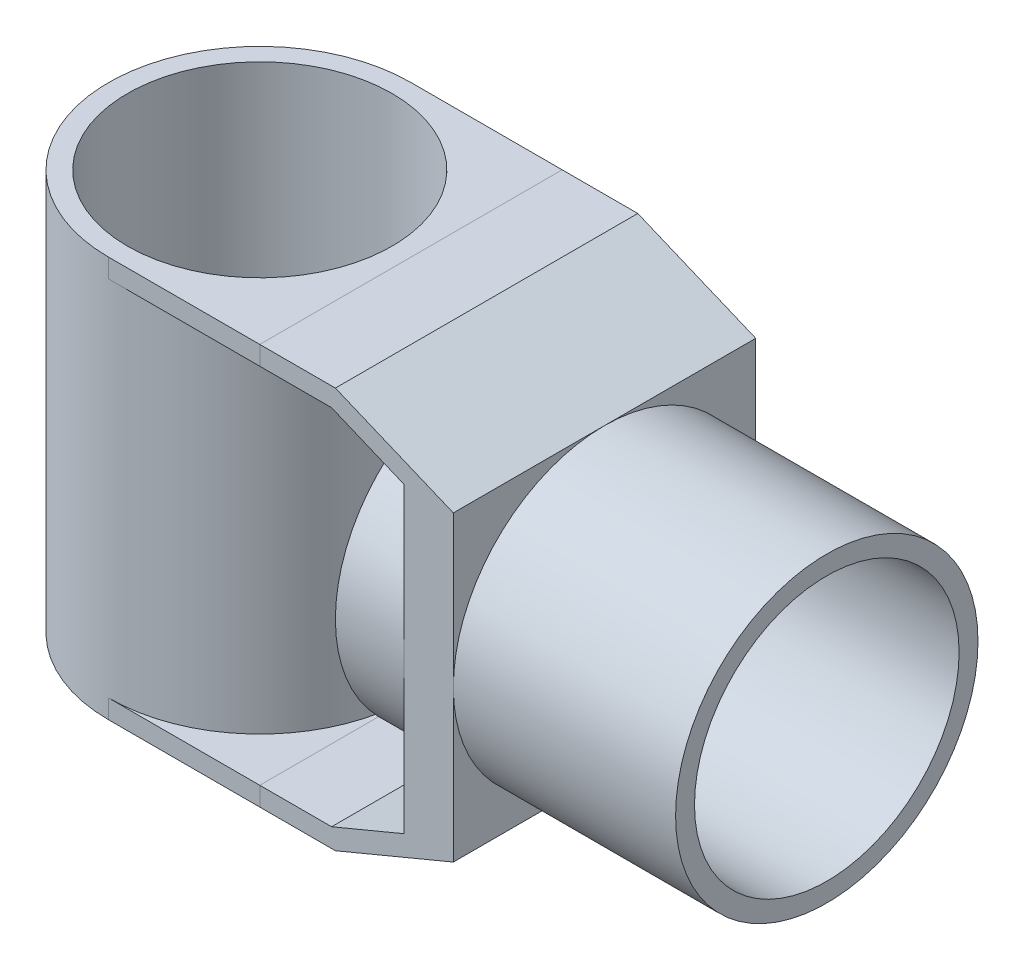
ISO-10303-21;
HEADER;
FILE_DESCRIPTION(('STEP AP214'),'2;1');
FILE_NAME('part.step','',(''),(''),'','','');
FILE_SCHEMA(('AUTOMOTIVE_DESIGN { 1 0 10303 214 1 1 1 1 }'));
ENDSEC;
DATA;
#1=APPLICATION_CONTEXT('core data for automotive mechanical design processes');
#2=APPLICATION_PROTOCOL_DEFINITION('international standard','automotive_design',2000,#1);
#3=PRODUCT_CONTEXT('',#1,'mechanical');
#4=PRODUCT('Part','Part','',(#3));
#5=PRODUCT_RELATED_PRODUCT_CATEGORY('part','',(#4));
#6=PRODUCT_DEFINITION_FORMATION('','',#4);
#7=PRODUCT_DEFINITION_CONTEXT('part definition',#1,'design');
#8=PRODUCT_DEFINITION('design','',#6,#7);
#9=PRODUCT_DEFINITION_SHAPE('','',#8);
#10=(LENGTH_UNIT() NAMED_UNIT(*) SI_UNIT(.MILLI.,.METRE.));
#11=(NAMED_UNIT(*) PLANE_ANGLE_UNIT() SI_UNIT($,.RADIAN.));
#12=(NAMED_UNIT(*) SI_UNIT($,.STERADIAN.) SOLID_ANGLE_UNIT());
#13=UNCERTAINTY_MEASURE_WITH_UNIT(LENGTH_MEASURE(1.E-05),#10,'distance_accuracy_value','');
#14=(GEOMETRIC_REPRESENTATION_CONTEXT(3) GLOBAL_UNCERTAINTY_ASSIGNED_CONTEXT((#13)) GLOBAL_UNIT_ASSIGNED_CONTEXT((#10,
#11,#12)) REPRESENTATION_CONTEXT('',''));
#15=CARTESIAN_POINT('',(0.,0.,0.));
#16=DIRECTION('',(0.,0.,1.));
#17=DIRECTION('',(1.,0.,0.));
#18=AXIS2_PLACEMENT_3D('',#15,#16,#17);
#19=CARTESIAN_POINT('',(180.,0.,0.));
#20=DIRECTION('',(-1.,0.,0.));
#21=DIRECTION('',(0.,0.,1.));
#22=AXIS2_PLACEMENT_3D('',#19,#20,#21);
#23=CYLINDRICAL_SURFACE('',#22,80.);
#24=CARTESIAN_POINT('',(0.,0.,0.));
#25=DIRECTION('',(-1.,0.,0.));
#26=DIRECTION('',(0.,0.,1.));
#27=AXIS2_PLACEMENT_3D('',#24,#25,#26);
#28=CIRCLE('',#27,80.);
#29=CARTESIAN_POINT('',(0.,0.,80.));
#30=VERTEX_POINT('',#29);
#31=EDGE_CURVE('E319',#30,#30,#28,.T.);
#32=ORIENTED_EDGE('',*,*,#31,.F.);
#33=EDGE_LOOP('',(#32));
#34=FACE_BOUND('',#33,.T.);
#35=CARTESIAN_POINT('',(36.4000000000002,0.,0.));
#36=DIRECTION('',(1.,0.,0.));
#37=DIRECTION('',(0.,1.,0.));
#38=AXIS2_PLACEMENT_3D('',#35,#36,#37);
#39=CIRCLE('',#38,80.);
#40=CARTESIAN_POINT('',(36.4000000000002,80.,0.));
#41=VERTEX_POINT('',#40);
#42=CARTESIAN_POINT('',(36.4000000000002,0.,80.));
#43=VERTEX_POINT('',#42);
#44=EDGE_CURVE('E327',#41,#43,#39,.T.);
#45=ORIENTED_EDGE('',*,*,#44,.F.);
#46=CARTESIAN_POINT('',(36.4000000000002,0.,0.));
#47=DIRECTION('',(1.,0.,0.));
#48=DIRECTION('',(0.,1.,0.));
#49=AXIS2_PLACEMENT_3D('',#46,#47,#48);
#50=CIRCLE('',#49,80.);
#51=CARTESIAN_POINT('',(36.4000000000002,0.,-80.));
#52=VERTEX_POINT('',#51);
#53=EDGE_CURVE('E201',#52,#41,#50,.T.);
#54=ORIENTED_EDGE('',*,*,#53,.F.);
#55=CARTESIAN_POINT('',(36.4000000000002,0.,0.));
#56=DIRECTION('',(1.,0.,0.));
#57=DIRECTION('',(0.,0.,-1.));
#58=AXIS2_PLACEMENT_3D('',#55,#56,#57);
#59=CIRCLE('',#58,80.);
#60=CARTESIAN_POINT('',(36.4000000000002,-80.,0.));
#61=VERTEX_POINT('',#60);
#62=EDGE_CURVE('E303',#61,#52,#59,.T.);
#63=ORIENTED_EDGE('',*,*,#62,.F.);
#64=CARTESIAN_POINT('',(36.4000000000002,0.,0.));
#65=DIRECTION('',(1.,0.,0.));
#66=DIRECTION('',(0.,0.,-1.));
#67=AXIS2_PLACEMENT_3D('',#64,#65,#66);
#68=CIRCLE('',#67,80.);
#69=EDGE_CURVE('E222',#43,#61,#68,.T.);
#70=ORIENTED_EDGE('',*,*,#69,.F.);
#71=EDGE_LOOP('',(#45,#54,#63,#70));
#72=FACE_BOUND('',#71,.T.);
#73=ADVANCED_FACE('F49',(#34,#72),#23,.T.);
#74=CARTESIAN_POINT('',(180.,0.,0.));
#75=DIRECTION('',(-1.,0.,0.));
#76=DIRECTION('',(0.,0.,1.));
#77=AXIS2_PLACEMENT_3D('',#74,#75,#76);
#78=CIRCLE('',#77,80.);
#79=CARTESIAN_POINT('',(180.,0.,80.));
#80=VERTEX_POINT('',#79);
#81=EDGE_CURVE('E323',#80,#80,#78,.T.);
#82=ORIENTED_EDGE('',*,*,#81,.T.);
#83=EDGE_LOOP('',(#82));
#84=FACE_BOUND('',#83,.T.);
#85=CARTESIAN_POINT('',(62.4000000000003,0.,0.));
#86=DIRECTION('',(-1.,0.,0.));
#87=DIRECTION('',(0.,0.,1.));
#88=AXIS2_PLACEMENT_3D('',#85,#86,#87);
#89=CIRCLE('',#88,80.);
#90=CARTESIAN_POINT('',(62.4000000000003,0.,-80.));
#91=VERTEX_POINT('',#90);
#92=CARTESIAN_POINT('',(62.4000000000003,-80.,0.));
#93=VERTEX_POINT('',#92);
#94=EDGE_CURVE('E294',#91,#93,#89,.T.);
#95=ORIENTED_EDGE('',*,*,#94,.F.);
#96=CARTESIAN_POINT('',(62.4000000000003,0.,0.));
#97=DIRECTION('',(-1.,0.,0.));
#98=DIRECTION('',(0.,-1.,0.));
#99=AXIS2_PLACEMENT_3D('',#96,#97,#98);
#100=CIRCLE('',#99,80.);
#101=CARTESIAN_POINT('',(62.4000000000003,80.,0.));
#102=VERTEX_POINT('',#101);
#103=EDGE_CURVE('E195',#102,#91,#100,.T.);
#104=ORIENTED_EDGE('',*,*,#103,.F.);
#105=CARTESIAN_POINT('',(62.4000000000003,0.,0.));
#106=DIRECTION('',(-1.,0.,0.));
#107=DIRECTION('',(0.,-1.,0.));
#108=AXIS2_PLACEMENT_3D('',#105,#106,#107);
#109=CIRCLE('',#108,80.);
#110=CARTESIAN_POINT('',(62.4000000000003,0.,80.));
#111=VERTEX_POINT('',#110);
#112=EDGE_CURVE('E120',#111,#102,#109,.T.);
#113=ORIENTED_EDGE('',*,*,#112,.F.);
#114=CARTESIAN_POINT('',(62.4000000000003,0.,0.));
#115=DIRECTION('',(-1.,0.,0.));
#116=DIRECTION('',(0.,0.,1.));
#117=AXIS2_PLACEMENT_3D('',#114,#115,#116);
#118=CIRCLE('',#117,80.);
#119=EDGE_CURVE('E217',#93,#111,#118,.T.);
#120=ORIENTED_EDGE('',*,*,#119,.F.);
#121=EDGE_LOOP('',(#95,#104,#113,#120));
#122=FACE_BOUND('',#121,.T.);
#123=ADVANCED_FACE('F352',(#84,#122),#23,.T.);
#124=CARTESIAN_POINT('',(-40.,106.,80.));
#125=DIRECTION('',(1.,0.,0.));
#126=DIRECTION('',(0.,0.,-1.));
#127=AXIS2_PLACEMENT_3D('',#124,#125,#126);
#128=PLANE('',#127);
#129=DIRECTION('',(0.,-1.,0.));
#130=VECTOR('',#129,1.);
#131=CARTESIAN_POINT('',(-40.,106.,-80.));
#132=LINE('',#131,#130);
#133=CARTESIAN_POINT('',(-40.,106.,-80.));
#134=VERTEX_POINT('',#133);
#135=CARTESIAN_POINT('',(-40.,96.,-80.));
#136=VERTEX_POINT('',#135);
#137=EDGE_CURVE('E149',#134,#136,#132,.T.);
#138=ORIENTED_EDGE('',*,*,#137,.T.);
#139=DIRECTION('',(0.,0.,-1.));
#140=VECTOR('',#139,1.);
#141=CARTESIAN_POINT('',(-40.,96.,80.));
#142=LINE('',#141,#140);
#143=CARTESIAN_POINT('',(-40.,96.,80.));
#144=VERTEX_POINT('',#143);
#145=EDGE_CURVE('E12',#144,#136,#142,.T.);
#146=ORIENTED_EDGE('',*,*,#145,.F.);
#147=DIRECTION('',(0.,-1.,0.));
#148=VECTOR('',#147,1.);
#149=CARTESIAN_POINT('',(-40.,106.,80.));
#150=LINE('',#149,#148);
#151=CARTESIAN_POINT('',(-40.,106.,80.));
#152=VERTEX_POINT('',#151);
#153=EDGE_CURVE('E163',#152,#144,#150,.T.);
#154=ORIENTED_EDGE('',*,*,#153,.F.);
#155=DIRECTION('',(0.,0.,-1.));
#156=VECTOR('',#155,1.);
#157=CARTESIAN_POINT('',(-40.,106.,80.));
#158=LINE('',#157,#156);
#159=EDGE_CURVE('E143',#152,#134,#158,.T.);
#160=ORIENTED_EDGE('',*,*,#159,.T.);
#161=EDGE_LOOP('',(#138,#146,#154,#160));
#162=FACE_BOUND('',#161,.T.);
#163=ADVANCED_FACE('F51',(#162),#128,.F.);
#164=CARTESIAN_POINT('',(-40.,96.,80.));
#165=DIRECTION('',(0.,1.,0.));
#166=DIRECTION('',(0.,0.,1.));
#167=AXIS2_PLACEMENT_3D('',#164,#165,#166);
#168=PLANE('',#167);
#169=DIRECTION('',(1.,0.,0.));
#170=VECTOR('',#169,1.);
#171=CARTESIAN_POINT('',(-40.,96.,-80.));
#172=LINE('',#171,#170);
#173=CARTESIAN_POINT('',(-1.99999999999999,96.,-80.));
#174=VERTEX_POINT('',#173);
#175=EDGE_CURVE('E153',#136,#174,#172,.T.);
#176=ORIENTED_EDGE('',*,*,#175,.T.);
#177=DIRECTION('',(0.,0.,-1.));
#178=VECTOR('',#177,1.);
#179=CARTESIAN_POINT('',(-1.99999999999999,96.,80.));
#180=LINE('',#179,#178);
#181=CARTESIAN_POINT('',(-1.99999999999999,96.,80.));
#182=VERTEX_POINT('',#181);
#183=EDGE_CURVE('E59',#182,#174,#180,.T.);
#184=ORIENTED_EDGE('',*,*,#183,.F.);
#185=DIRECTION('',(1.,0.,0.));
#186=VECTOR('',#185,1.);
#187=CARTESIAN_POINT('',(-40.,96.,80.));
#188=LINE('',#187,#186);
#189=EDGE_CURVE('E104',#144,#182,#188,.T.);
#190=ORIENTED_EDGE('',*,*,#189,.F.);
#191=ORIENTED_EDGE('',*,*,#145,.T.);
#192=EDGE_LOOP('',(#176,#184,#190,#191));
#193=FACE_BOUND('',#192,.T.);
#194=ADVANCED_FACE('F345',(#193),#168,.F.);
#195=CARTESIAN_POINT('',(-1.99999999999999,96.,80.));
#196=DIRECTION('',(0.384615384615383,0.923076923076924,0.));
#197=DIRECTION('',(-0.923076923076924,0.384615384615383,0.));
#198=AXIS2_PLACEMENT_3D('',#195,#196,#197);
#199=PLANE('',#198);
#200=DIRECTION('',(0.923076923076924,-0.384615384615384,0.));
#201=VECTOR('',#200,1.);
#202=CARTESIAN_POINT('',(-1.99999999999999,96.,-80.));
#203=LINE('',#202,#201);
#204=CARTESIAN_POINT('',(36.4000000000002,80.,-80.));
#205=VERTEX_POINT('',#204);
#206=EDGE_CURVE('E156',#174,#205,#203,.T.);
#207=ORIENTED_EDGE('',*,*,#206,.T.);
#208=DIRECTION('',(0.,0.,-1.));
#209=VECTOR('',#208,1.);
#210=CARTESIAN_POINT('',(36.4000000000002,80.,80.));
#211=LINE('',#210,#209);
#212=EDGE_CURVE('E124',#41,#205,#211,.T.);
#213=ORIENTED_EDGE('',*,*,#212,.F.);
#214=CARTESIAN_POINT('',(36.4000000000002,80.,80.));
#215=VERTEX_POINT('',#214);
#216=EDGE_CURVE('E168',#215,#41,#211,.T.);
#217=ORIENTED_EDGE('',*,*,#216,.F.);
#218=DIRECTION('',(0.923076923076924,-0.384615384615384,0.));
#219=VECTOR('',#218,1.);
#220=CARTESIAN_POINT('',(-1.99999999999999,96.,80.));
#221=LINE('',#220,#219);
#222=EDGE_CURVE('E139',#182,#215,#221,.T.);
#223=ORIENTED_EDGE('',*,*,#222,.F.);
#224=ORIENTED_EDGE('',*,*,#183,.T.);
#225=EDGE_LOOP('',(#207,#213,#217,#223,#224));
#226=FACE_BOUND('',#225,.T.);
#227=ADVANCED_FACE('F176',(#226),#199,.F.);
#228=CARTESIAN_POINT('',(0.,106.,80.));
#229=DIRECTION('',(-0.384615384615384,-0.923076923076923,0.));
#230=DIRECTION('',(0.923076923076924,-0.384615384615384,0.));
#231=AXIS2_PLACEMENT_3D('',#228,#229,#230);
#232=PLANE('',#231);
#233=DIRECTION('',(-0.923076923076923,0.384615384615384,0.));
#234=VECTOR('',#233,1.);
#235=CARTESIAN_POINT('',(0.,106.,-80.));
#236=LINE('',#235,#234);
#237=CARTESIAN_POINT('',(62.4000000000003,80.,-80.));
#238=VERTEX_POINT('',#237);
#239=CARTESIAN_POINT('',(0.,106.,-80.));
#240=VERTEX_POINT('',#239);
#241=EDGE_CURVE('E90',#238,#240,#236,.T.);
#242=ORIENTED_EDGE('',*,*,#241,.T.);
#243=DIRECTION('',(0.,0.,-1.));
#244=VECTOR('',#243,1.);
#245=CARTESIAN_POINT('',(0.,106.,80.));
#246=LINE('',#245,#244);
#247=CARTESIAN_POINT('',(0.,106.,80.));
#248=VERTEX_POINT('',#247);
#249=EDGE_CURVE('E137',#248,#240,#246,.T.);
#250=ORIENTED_EDGE('',*,*,#249,.F.);
#251=DIRECTION('',(-0.923076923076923,0.384615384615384,0.));
#252=VECTOR('',#251,1.);
#253=CARTESIAN_POINT('',(0.,106.,80.));
#254=LINE('',#253,#252);
#255=CARTESIAN_POINT('',(62.4000000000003,80.,80.));
#256=VERTEX_POINT('',#255);
#257=EDGE_CURVE('E129',#256,#248,#254,.T.);
#258=ORIENTED_EDGE('',*,*,#257,.F.);
#259=DIRECTION('',(0.,0.,-1.));
#260=VECTOR('',#259,1.);
#261=CARTESIAN_POINT('',(62.4000000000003,80.,80.));
#262=LINE('',#261,#260);
#263=EDGE_CURVE('E113',#256,#102,#262,.T.);
#264=ORIENTED_EDGE('',*,*,#263,.T.);
#265=EDGE_CURVE('E125',#102,#238,#262,.T.);
#266=ORIENTED_EDGE('',*,*,#265,.T.);
#267=EDGE_LOOP('',(#242,#250,#258,#264,#266));
#268=FACE_BOUND('',#267,.T.);
#269=ADVANCED_FACE('F136',(#268),#232,.F.);
#270=CARTESIAN_POINT('',(-40.,106.,80.));
#271=DIRECTION('',(0.,-1.,0.));
#272=DIRECTION('',(0.,0.,-1.));
#273=AXIS2_PLACEMENT_3D('',#270,#271,#272);
#274=PLANE('',#273);
#275=DIRECTION('',(-1.,0.,0.));
#276=VECTOR('',#275,1.);
#277=CARTESIAN_POINT('',(-40.,106.,-80.));
#278=LINE('',#277,#276);
#279=EDGE_CURVE('E96',#240,#134,#278,.T.);
#280=ORIENTED_EDGE('',*,*,#279,.T.);
#281=ORIENTED_EDGE('',*,*,#159,.F.);
#282=DIRECTION('',(-1.,0.,0.));
#283=VECTOR('',#282,1.);
#284=CARTESIAN_POINT('',(-40.,106.,80.));
#285=LINE('',#284,#283);
#286=EDGE_CURVE('E67',#248,#152,#285,.T.);
#287=ORIENTED_EDGE('',*,*,#286,.F.);
#288=ORIENTED_EDGE('',*,*,#249,.T.);
#289=EDGE_LOOP('',(#280,#281,#287,#288));
#290=FACE_BOUND('',#289,.T.);
#291=ADVANCED_FACE('F375',(#290),#274,.F.);
#292=CARTESIAN_POINT('',(0.,0.,80.));
#293=DIRECTION('',(0.,0.,1.));
#294=DIRECTION('',(1.,0.,0.));
#295=AXIS2_PLACEMENT_3D('',#292,#293,#294);
#296=PLANE('',#295);
#297=ORIENTED_EDGE('',*,*,#153,.T.);
#298=ORIENTED_EDGE('',*,*,#189,.T.);
#299=ORIENTED_EDGE('',*,*,#222,.T.);
#300=DIRECTION('',(0.,1.,0.));
#301=VECTOR('',#300,1.);
#302=CARTESIAN_POINT('',(36.4000000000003,-106.002,80.));
#303=LINE('',#302,#301);
#304=EDGE_CURVE('E134',#43,#215,#303,.T.);
#305=ORIENTED_EDGE('',*,*,#304,.F.);
#306=DIRECTION('',(0.,-1.,0.));
#307=VECTOR('',#306,1.);
#308=CARTESIAN_POINT('',(36.4000000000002,80.002,80.));
#309=LINE('',#308,#307);
#310=CARTESIAN_POINT('',(36.4000000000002,-80.,80.));
#311=VERTEX_POINT('',#310);
#312=EDGE_CURVE('E226',#43,#311,#309,.T.);
#313=ORIENTED_EDGE('',*,*,#312,.T.);
#314=DIRECTION('',(-0.923076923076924,-0.384615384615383,0.));
#315=VECTOR('',#314,1.);
#316=CARTESIAN_POINT('',(-1.99999999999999,-96.,80.));
#317=LINE('',#316,#315);
#318=CARTESIAN_POINT('',(-1.99999999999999,-96.,80.));
#319=VERTEX_POINT('',#318);
#320=EDGE_CURVE('E232',#311,#319,#317,.T.);
#321=ORIENTED_EDGE('',*,*,#320,.T.);
#322=DIRECTION('',(-1.,0.,0.));
#323=VECTOR('',#322,1.);
#324=CARTESIAN_POINT('',(-40.,-96.,80.));
#325=LINE('',#324,#323);
#326=CARTESIAN_POINT('',(-40.,-96.,80.));
#327=VERTEX_POINT('',#326);
#328=EDGE_CURVE('E236',#319,#327,#325,.T.);
#329=ORIENTED_EDGE('',*,*,#328,.T.);
#330=DIRECTION('',(0.,-1.,0.));
#331=VECTOR('',#330,1.);
#332=CARTESIAN_POINT('',(-40.,-106.,80.));
#333=LINE('',#332,#331);
#334=CARTESIAN_POINT('',(-40.,-106.,80.));
#335=VERTEX_POINT('',#334);
#336=EDGE_CURVE('E241',#327,#335,#333,.T.);
#337=ORIENTED_EDGE('',*,*,#336,.T.);
#338=DIRECTION('',(1.,0.,0.));
#339=VECTOR('',#338,1.);
#340=CARTESIAN_POINT('',(-40.,-106.,80.));
#341=LINE('',#340,#339);
#342=CARTESIAN_POINT('',(0.,-106.,80.));
#343=VERTEX_POINT('',#342);
#344=EDGE_CURVE('E245',#335,#343,#341,.T.);
#345=ORIENTED_EDGE('',*,*,#344,.T.);
#346=DIRECTION('',(0.923076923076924,0.384615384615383,0.));
#347=VECTOR('',#346,1.);
#348=CARTESIAN_POINT('',(0.,-106.,80.));
#349=LINE('',#348,#347);
#350=CARTESIAN_POINT('',(62.4000000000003,-80.,80.));
#351=VERTEX_POINT('',#350);
#352=EDGE_CURVE('E249',#343,#351,#349,.T.);
#353=ORIENTED_EDGE('',*,*,#352,.T.);
#354=DIRECTION('',(0.,-1.,0.));
#355=VECTOR('',#354,1.);
#356=CARTESIAN_POINT('',(62.4000000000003,80.002,80.));
#357=LINE('',#356,#355);
#358=EDGE_CURVE('E132',#111,#351,#357,.T.);
#359=ORIENTED_EDGE('',*,*,#358,.F.);
#360=DIRECTION('',(0.,1.,0.));
#361=VECTOR('',#360,1.);
#362=CARTESIAN_POINT('',(62.4000000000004,-106.002,80.));
#363=LINE('',#362,#361);
#364=EDGE_CURVE('E117',#111,#256,#363,.T.);
#365=ORIENTED_EDGE('',*,*,#364,.T.);
#366=ORIENTED_EDGE('',*,*,#257,.T.);
#367=ORIENTED_EDGE('',*,*,#286,.T.);
#368=EDGE_LOOP('',(#297,#298,#299,#305,#313,#321,#329,#337,#345,#353,#359,#365,#366,#367));
#369=FACE_BOUND('',#368,.T.);
#370=ADVANCED_FACE('F128',(#369),#296,.T.);
#371=CARTESIAN_POINT('',(0.,0.,-80.));
#372=DIRECTION('',(0.,0.,1.));
#373=DIRECTION('',(1.,0.,0.));
#374=AXIS2_PLACEMENT_3D('',#371,#372,#373);
#375=PLANE('',#374);
#376=ORIENTED_EDGE('',*,*,#137,.F.);
#377=ORIENTED_EDGE('',*,*,#279,.F.);
#378=ORIENTED_EDGE('',*,*,#241,.F.);
#379=DIRECTION('',(0.,1.,0.));
#380=VECTOR('',#379,1.);
#381=CARTESIAN_POINT('',(62.4000000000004,-106.002,-80.));
#382=LINE('',#381,#380);
#383=EDGE_CURVE('E196',#91,#238,#382,.T.);
#384=ORIENTED_EDGE('',*,*,#383,.F.);
#385=DIRECTION('',(0.,-1.,0.));
#386=VECTOR('',#385,1.);
#387=CARTESIAN_POINT('',(62.4000000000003,80.002,-80.));
#388=LINE('',#387,#386);
#389=CARTESIAN_POINT('',(62.4000000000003,-80.,-80.));
#390=VERTEX_POINT('',#389);
#391=EDGE_CURVE('E300',#91,#390,#388,.T.);
#392=ORIENTED_EDGE('',*,*,#391,.T.);
#393=DIRECTION('',(0.923076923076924,0.384615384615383,0.));
#394=VECTOR('',#393,1.);
#395=CARTESIAN_POINT('',(0.,-106.,-80.));
#396=LINE('',#395,#394);
#397=CARTESIAN_POINT('',(0.,-106.,-80.));
#398=VERTEX_POINT('',#397);
#399=EDGE_CURVE('E237',#398,#390,#396,.T.);
#400=ORIENTED_EDGE('',*,*,#399,.F.);
#401=DIRECTION('',(1.,0.,0.));
#402=VECTOR('',#401,1.);
#403=CARTESIAN_POINT('',(-40.,-106.,-80.));
#404=LINE('',#403,#402);
#405=CARTESIAN_POINT('',(-40.,-106.,-80.));
#406=VERTEX_POINT('',#405);
#407=EDGE_CURVE('E264',#406,#398,#404,.T.);
#408=ORIENTED_EDGE('',*,*,#407,.F.);
#409=DIRECTION('',(0.,-1.,0.));
#410=VECTOR('',#409,1.);
#411=CARTESIAN_POINT('',(-40.,-106.,-80.));
#412=LINE('',#411,#410);
#413=CARTESIAN_POINT('',(-40.,-96.,-80.));
#414=VERTEX_POINT('',#413);
#415=EDGE_CURVE('E260',#414,#406,#412,.T.);
#416=ORIENTED_EDGE('',*,*,#415,.F.);
#417=DIRECTION('',(-1.,0.,0.));
#418=VECTOR('',#417,1.);
#419=CARTESIAN_POINT('',(-40.,-96.,-80.));
#420=LINE('',#419,#418);
#421=CARTESIAN_POINT('',(-1.99999999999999,-96.,-80.));
#422=VERTEX_POINT('',#421);
#423=EDGE_CURVE('E256',#422,#414,#420,.T.);
#424=ORIENTED_EDGE('',*,*,#423,.F.);
#425=DIRECTION('',(-0.923076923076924,-0.384615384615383,0.));
#426=VECTOR('',#425,1.);
#427=CARTESIAN_POINT('',(-1.99999999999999,-96.,-80.));
#428=LINE('',#427,#426);
#429=CARTESIAN_POINT('',(36.4000000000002,-80.,-80.));
#430=VERTEX_POINT('',#429);
#431=EDGE_CURVE('E221',#430,#422,#428,.T.);
#432=ORIENTED_EDGE('',*,*,#431,.F.);
#433=DIRECTION('',(0.,-1.,0.));
#434=VECTOR('',#433,1.);
#435=CARTESIAN_POINT('',(36.4000000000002,80.002,-80.));
#436=LINE('',#435,#434);
#437=EDGE_CURVE('E190',#52,#430,#436,.T.);
#438=ORIENTED_EDGE('',*,*,#437,.F.);
#439=DIRECTION('',(0.,1.,0.));
#440=VECTOR('',#439,1.);
#441=CARTESIAN_POINT('',(36.4000000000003,-106.002,-80.));
#442=LINE('',#441,#440);
#443=EDGE_CURVE('E185',#52,#205,#442,.T.);
#444=ORIENTED_EDGE('',*,*,#443,.T.);
#445=ORIENTED_EDGE('',*,*,#206,.F.);
#446=ORIENTED_EDGE('',*,*,#175,.F.);
#447=EDGE_LOOP('',(#376,#377,#378,#384,#392,#400,#408,#416,#424,#432,#438,#444,#445,#446));
#448=FACE_BOUND('',#447,.T.);
#449=ADVANCED_FACE('F182',(#448),#375,.F.);
#450=CARTESIAN_POINT('',(36.4000000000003,-106.002,80.));
#451=DIRECTION('',(1.,0.,0.));
#452=DIRECTION('',(0.,1.,0.));
#453=AXIS2_PLACEMENT_3D('',#450,#451,#452);
#454=PLANE('',#453);
#455=ORIENTED_EDGE('',*,*,#216,.T.);
#456=ORIENTED_EDGE('',*,*,#44,.T.);
#457=ORIENTED_EDGE('',*,*,#304,.T.);
#458=EDGE_LOOP('',(#455,#456,#457));
#459=FACE_BOUND('',#458,.T.);
#460=ADVANCED_FACE('F366',(#459),#454,.F.);
#461=CARTESIAN_POINT('',(62.4000000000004,-106.002,-80.));
#462=DIRECTION('',(-1.,0.,0.));
#463=DIRECTION('',(0.,-1.,0.));
#464=AXIS2_PLACEMENT_3D('',#461,#462,#463);
#465=PLANE('',#464);
#466=ORIENTED_EDGE('',*,*,#364,.F.);
#467=ORIENTED_EDGE('',*,*,#112,.T.);
#468=ORIENTED_EDGE('',*,*,#263,.F.);
#469=EDGE_LOOP('',(#466,#467,#468));
#470=FACE_BOUND('',#469,.T.);
#471=ADVANCED_FACE('F115',(#470),#465,.F.);
#472=CARTESIAN_POINT('',(180.,0.,0.));
#473=DIRECTION('',(-1.,0.,0.));
#474=DIRECTION('',(0.,0.,1.));
#475=AXIS2_PLACEMENT_3D('',#472,#473,#474);
#476=PLANE('',#475);
#477=CARTESIAN_POINT('',(180.,0.,0.));
#478=DIRECTION('',(-1.,0.,0.));
#479=DIRECTION('',(0.,0.,1.));
#480=AXIS2_PLACEMENT_3D('',#477,#478,#479);
#481=CIRCLE('',#480,70.0000000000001);
#482=CARTESIAN_POINT('',(180.,0.,70.0000000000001));
#483=VERTEX_POINT('',#482);
#484=EDGE_CURVE('E315',#483,#483,#481,.T.);
#485=ORIENTED_EDGE('',*,*,#484,.T.);
#486=EDGE_LOOP('',(#485));
#487=FACE_BOUND('',#486,.T.);
#488=ORIENTED_EDGE('',*,*,#81,.F.);
#489=EDGE_LOOP('',(#488));
#490=FACE_BOUND('',#489,.T.);
#491=ADVANCED_FACE('F372',(#487,#490),#476,.F.);
#492=CARTESIAN_POINT('',(0.,0.,0.));
#493=DIRECTION('',(-1.,0.,0.));
#494=DIRECTION('',(0.,0.,1.));
#495=AXIS2_PLACEMENT_3D('',#492,#493,#494);
#496=PLANE('',#495);
#497=CARTESIAN_POINT('',(0.,0.,0.));
#498=DIRECTION('',(-1.,0.,0.));
#499=DIRECTION('',(0.,0.,1.));
#500=AXIS2_PLACEMENT_3D('',#497,#498,#499);
#501=CIRCLE('',#500,70.0000000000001);
#502=CARTESIAN_POINT('',(0.,0.,70.0000000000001));
#503=VERTEX_POINT('',#502);
#504=EDGE_CURVE('E309',#503,#503,#501,.T.);
#505=ORIENTED_EDGE('',*,*,#504,.F.);
#506=EDGE_LOOP('',(#505));
#507=FACE_BOUND('',#506,.T.);
#508=ORIENTED_EDGE('',*,*,#31,.T.);
#509=EDGE_LOOP('',(#508));
#510=FACE_BOUND('',#509,.T.);
#511=ADVANCED_FACE('F364',(#507,#510),#496,.T.);
#512=CARTESIAN_POINT('',(180.,0.,0.));
#513=DIRECTION('',(-1.,0.,0.));
#514=DIRECTION('',(0.,0.,1.));
#515=AXIS2_PLACEMENT_3D('',#512,#513,#514);
#516=CYLINDRICAL_SURFACE('',#515,70.0000000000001);
#517=CARTESIAN_POINT('',(180.,0.,70.0000000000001));
#518=CARTESIAN_POINT('',(178.125,0.,70.0000000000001));
#519=CARTESIAN_POINT('',(176.25,0.,70.0000000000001));
#520=CARTESIAN_POINT('',(172.5,0.,70.0000000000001));
#521=CARTESIAN_POINT('',(170.625,0.,70.0000000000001));
#522=CARTESIAN_POINT('',(166.875,0.,70.0000000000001));
#523=CARTESIAN_POINT('',(165.,0.,70.0000000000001));
#524=CARTESIAN_POINT('',(161.25,0.,70.0000000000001));
#525=CARTESIAN_POINT('',(159.375,0.,70.0000000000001));
#526=CARTESIAN_POINT('',(155.625,0.,70.0000000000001));
#527=CARTESIAN_POINT('',(153.75,0.,70.0000000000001));
#528=CARTESIAN_POINT('',(150.,0.,70.0000000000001));
#529=CARTESIAN_POINT('',(148.125,0.,70.0000000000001));
#530=CARTESIAN_POINT('',(144.375,0.,70.0000000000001));
#531=CARTESIAN_POINT('',(142.5,0.,70.0000000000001));
#532=CARTESIAN_POINT('',(138.75,0.,70.0000000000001));
#533=CARTESIAN_POINT('',(136.875,0.,70.0000000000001));
#534=CARTESIAN_POINT('',(133.125,0.,70.0000000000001));
#535=CARTESIAN_POINT('',(131.25,0.,70.0000000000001));
#536=CARTESIAN_POINT('',(127.5,0.,70.0000000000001));
#537=CARTESIAN_POINT('',(125.625,0.,70.0000000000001));
#538=CARTESIAN_POINT('',(121.875,0.,70.0000000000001));
#539=CARTESIAN_POINT('',(120.,0.,70.0000000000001));
#540=CARTESIAN_POINT('',(116.25,0.,70.0000000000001));
#541=CARTESIAN_POINT('',(114.375,0.,70.0000000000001));
#542=CARTESIAN_POINT('',(110.625,0.,70.0000000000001));
#543=CARTESIAN_POINT('',(108.75,0.,70.0000000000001));
#544=CARTESIAN_POINT('',(105.,0.,70.0000000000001));
#545=CARTESIAN_POINT('',(103.125,0.,70.0000000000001));
#546=CARTESIAN_POINT('',(99.375,0.,70.0000000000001));
#547=CARTESIAN_POINT('',(97.5,0.,70.0000000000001));
#548=CARTESIAN_POINT('',(93.75,0.,70.0000000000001));
#549=CARTESIAN_POINT('',(91.875,0.,70.0000000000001));
#550=CARTESIAN_POINT('',(88.125,0.,70.0000000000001));
#551=CARTESIAN_POINT('',(86.25,0.,70.0000000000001));
#552=CARTESIAN_POINT('',(82.5,0.,70.0000000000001));
#553=CARTESIAN_POINT('',(80.625,0.,70.0000000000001));
#554=CARTESIAN_POINT('',(76.875,0.,70.0000000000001));
#555=CARTESIAN_POINT('',(75.,0.,70.0000000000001));
#556=CARTESIAN_POINT('',(71.25,0.,70.0000000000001));
#557=CARTESIAN_POINT('',(69.375,0.,70.0000000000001));
#558=CARTESIAN_POINT('',(65.625,0.,70.0000000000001));
#559=CARTESIAN_POINT('',(63.75,0.,70.0000000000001));
#560=CARTESIAN_POINT('',(60.,0.,70.0000000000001));
#561=CARTESIAN_POINT('',(58.125,0.,70.0000000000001));
#562=CARTESIAN_POINT('',(54.375,0.,70.0000000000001));
#563=CARTESIAN_POINT('',(52.5,0.,70.0000000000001));
#564=CARTESIAN_POINT('',(48.75,0.,70.0000000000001));
#565=CARTESIAN_POINT('',(46.875,0.,70.0000000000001));
#566=CARTESIAN_POINT('',(43.125,0.,70.0000000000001));
#567=CARTESIAN_POINT('',(41.25,0.,70.0000000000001));
#568=CARTESIAN_POINT('',(37.5,0.,70.0000000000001));
#569=CARTESIAN_POINT('',(35.625,0.,70.0000000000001));
#570=CARTESIAN_POINT('',(31.875,0.,70.0000000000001));
#571=CARTESIAN_POINT('',(30.,0.,70.0000000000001));
#572=CARTESIAN_POINT('',(26.25,0.,70.0000000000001));
#573=CARTESIAN_POINT('',(24.375,0.,70.0000000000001));
#574=CARTESIAN_POINT('',(20.625,0.,70.0000000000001));
#575=CARTESIAN_POINT('',(18.75,0.,70.0000000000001));
#576=CARTESIAN_POINT('',(15.,0.,70.0000000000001));
#577=CARTESIAN_POINT('',(13.125,0.,70.0000000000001));
#578=CARTESIAN_POINT('',(9.37500000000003,0.,70.0000000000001));
#579=CARTESIAN_POINT('',(7.50000000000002,0.,70.0000000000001));
#580=CARTESIAN_POINT('',(3.75000000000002,0.,70.0000000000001));
#581=CARTESIAN_POINT('',(1.87500000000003,0.,70.0000000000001));
#582=CARTESIAN_POINT('',(0.,0.,70.0000000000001));
#583=B_SPLINE_CURVE_WITH_KNOTS('',3,(#517,#518,#519,#520,#521,#522,#523,#524,#525,#526,#527,
#528,#529,#530,#531,#532,#533,#534,#535,#536,#537,#538,#539,#540,#541,#542,#543,#544,#545,#546,
#547,#548,#549,#550,#551,#552,#553,#554,#555,#556,#557,#558,#559,#560,#561,#562,#563,#564,#565,
#566,#567,#568,#569,#570,#571,#572,#573,#574,#575,#576,#577,#578,#579,#580,#581,#582),
.UNSPECIFIED.,.F.,.F.,(4,2,2,2,2,2,2,2,2,2,2,2,2,2,2,2,2,2,2,2,2,2,2,2,2,2,2,2,2,2,2,2,4),(0.,
5.62499999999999,11.25,16.875,22.5,28.125,33.75,39.375,45.,50.625,56.25,61.875,67.5,73.125,
78.75,84.375,90.,95.625,101.25,106.875,112.5,118.125,123.75,129.375,135.,140.625,146.25,151.875,
157.5,163.125,168.75,174.375,180.),.UNSPECIFIED.);
#584=EDGE_CURVE('BSEAM417',#483,#503,#583,.T.);
#585=ORIENTED_EDGE('',*,*,#484,.F.);
#586=ORIENTED_EDGE('',*,*,#504,.T.);
#587=ORIENTED_EDGE('',*,*,#584,.T.);
#588=ORIENTED_EDGE('',*,*,#584,.F.);
#589=EDGE_LOOP('',(#585,#587,#586,#588));
#590=FACE_BOUND('',#589,.T.);
#591=ADVANCED_FACE('F417',(#590),#516,.F.);
#592=CARTESIAN_POINT('',(36.4000000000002,80.002,-80.));
#593=DIRECTION('',(1.,0.,0.));
#594=DIRECTION('',(0.,0.,-1.));
#595=AXIS2_PLACEMENT_3D('',#592,#593,#594);
#596=PLANE('',#595);
#597=DIRECTION('',(0.,0.,1.));
#598=VECTOR('',#597,1.);
#599=CARTESIAN_POINT('',(36.4000000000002,-80.,-80.));
#600=LINE('',#599,#598);
#601=EDGE_CURVE('E295',#430,#61,#600,.T.);
#602=ORIENTED_EDGE('',*,*,#601,.T.);
#603=ORIENTED_EDGE('',*,*,#62,.T.);
#604=ORIENTED_EDGE('',*,*,#437,.T.);
#605=EDGE_LOOP('',(#602,#603,#604));
#606=FACE_BOUND('',#605,.T.);
#607=ADVANCED_FACE('F424',(#606),#596,.F.);
#608=CARTESIAN_POINT('',(62.4000000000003,80.002,80.));
#609=DIRECTION('',(-1.,0.,0.));
#610=DIRECTION('',(0.,0.,1.));
#611=AXIS2_PLACEMENT_3D('',#608,#609,#610);
#612=PLANE('',#611);
#613=ORIENTED_EDGE('',*,*,#391,.F.);
#614=ORIENTED_EDGE('',*,*,#94,.T.);
#615=DIRECTION('',(0.,0.,-1.));
#616=VECTOR('',#615,1.);
#617=CARTESIAN_POINT('',(62.4000000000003,-80.,80.));
#618=LINE('',#617,#616);
#619=EDGE_CURVE('E299',#93,#390,#618,.T.);
#620=ORIENTED_EDGE('',*,*,#619,.T.);
#621=EDGE_LOOP('',(#613,#614,#620));
#622=FACE_BOUND('',#621,.T.);
#623=ADVANCED_FACE('F432',(#622),#612,.F.);
#624=CARTESIAN_POINT('',(-1.99999999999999,-96.,80.));
#625=DIRECTION('',(0.384615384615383,-0.923076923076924,0.));
#626=DIRECTION('',(0.923076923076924,0.384615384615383,0.));
#627=AXIS2_PLACEMENT_3D('',#624,#625,#626);
#628=PLANE('',#627);
#629=ORIENTED_EDGE('',*,*,#431,.T.);
#630=DIRECTION('',(0.,0.,-1.));
#631=VECTOR('',#630,1.);
#632=CARTESIAN_POINT('',(-1.99999999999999,-96.,80.));
#633=LINE('',#632,#631);
#634=EDGE_CURVE('E286',#319,#422,#633,.T.);
#635=ORIENTED_EDGE('',*,*,#634,.F.);
#636=ORIENTED_EDGE('',*,*,#320,.F.);
#637=DIRECTION('',(0.,0.,-1.));
#638=VECTOR('',#637,1.);
#639=CARTESIAN_POINT('',(36.4000000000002,-80.,80.));
#640=LINE('',#639,#638);
#641=EDGE_CURVE('E290',#311,#61,#640,.T.);
#642=ORIENTED_EDGE('',*,*,#641,.T.);
#643=ORIENTED_EDGE('',*,*,#601,.F.);
#644=EDGE_LOOP('',(#629,#635,#636,#642,#643));
#645=FACE_BOUND('',#644,.T.);
#646=ADVANCED_FACE('F440',(#645),#628,.F.);
#647=CARTESIAN_POINT('',(-40.,-96.,80.));
#648=DIRECTION('',(0.,-1.,0.));
#649=DIRECTION('',(0.,0.,-1.));
#650=AXIS2_PLACEMENT_3D('',#647,#648,#649);
#651=PLANE('',#650);
#652=ORIENTED_EDGE('',*,*,#423,.T.);
#653=DIRECTION('',(0.,0.,-1.));
#654=VECTOR('',#653,1.);
#655=CARTESIAN_POINT('',(-40.,-96.,80.));
#656=LINE('',#655,#654);
#657=EDGE_CURVE('E282',#327,#414,#656,.T.);
#658=ORIENTED_EDGE('',*,*,#657,.F.);
#659=ORIENTED_EDGE('',*,*,#328,.F.);
#660=ORIENTED_EDGE('',*,*,#634,.T.);
#661=EDGE_LOOP('',(#652,#658,#659,#660));
#662=FACE_BOUND('',#661,.T.);
#663=ADVANCED_FACE('F448',(#662),#651,.F.);
#664=CARTESIAN_POINT('',(-40.,-106.,80.));
#665=DIRECTION('',(1.,0.,0.));
#666=DIRECTION('',(0.,0.,-1.));
#667=AXIS2_PLACEMENT_3D('',#664,#665,#666);
#668=PLANE('',#667);
#669=ORIENTED_EDGE('',*,*,#415,.T.);
#670=DIRECTION('',(0.,0.,-1.));
#671=VECTOR('',#670,1.);
#672=CARTESIAN_POINT('',(-40.,-106.,80.));
#673=LINE('',#672,#671);
#674=EDGE_CURVE('E278',#335,#406,#673,.T.);
#675=ORIENTED_EDGE('',*,*,#674,.F.);
#676=ORIENTED_EDGE('',*,*,#336,.F.);
#677=ORIENTED_EDGE('',*,*,#657,.T.);
#678=EDGE_LOOP('',(#669,#675,#676,#677));
#679=FACE_BOUND('',#678,.T.);
#680=ADVANCED_FACE('F456',(#679),#668,.F.);
#681=CARTESIAN_POINT('',(-40.,-106.,80.));
#682=DIRECTION('',(0.,1.,0.));
#683=DIRECTION('',(0.,0.,1.));
#684=AXIS2_PLACEMENT_3D('',#681,#682,#683);
#685=PLANE('',#684);
#686=ORIENTED_EDGE('',*,*,#407,.T.);
#687=DIRECTION('',(0.,0.,-1.));
#688=VECTOR('',#687,1.);
#689=CARTESIAN_POINT('',(0.,-106.,80.));
#690=LINE('',#689,#688);
#691=EDGE_CURVE('E274',#343,#398,#690,.T.);
#692=ORIENTED_EDGE('',*,*,#691,.F.);
#693=ORIENTED_EDGE('',*,*,#344,.F.);
#694=ORIENTED_EDGE('',*,*,#674,.T.);
#695=EDGE_LOOP('',(#686,#692,#693,#694));
#696=FACE_BOUND('',#695,.T.);
#697=ADVANCED_FACE('F464',(#696),#685,.F.);
#698=CARTESIAN_POINT('',(0.,-106.,80.));
#699=DIRECTION('',(-0.384615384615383,0.923076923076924,0.));
#700=DIRECTION('',(-0.923076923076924,-0.384615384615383,0.));
#701=AXIS2_PLACEMENT_3D('',#698,#699,#700);
#702=PLANE('',#701);
#703=ORIENTED_EDGE('',*,*,#399,.T.);
#704=ORIENTED_EDGE('',*,*,#619,.F.);
#705=DIRECTION('',(0.,0.,-1.));
#706=VECTOR('',#705,1.);
#707=CARTESIAN_POINT('',(62.4000000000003,-80.,80.));
#708=LINE('',#707,#706);
#709=EDGE_CURVE('E252',#351,#93,#708,.T.);
#710=ORIENTED_EDGE('',*,*,#709,.F.);
#711=ORIENTED_EDGE('',*,*,#352,.F.);
#712=ORIENTED_EDGE('',*,*,#691,.T.);
#713=EDGE_LOOP('',(#703,#704,#710,#711,#712));
#714=FACE_BOUND('',#713,.T.);
#715=ADVANCED_FACE('F472',(#714),#702,.F.);
#716=CARTESIAN_POINT('',(36.4000000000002,80.002,-80.));
#717=DIRECTION('',(1.,0.,0.));
#718=DIRECTION('',(0.,0.,-1.));
#719=AXIS2_PLACEMENT_3D('',#716,#717,#718);
#720=PLANE('',#719);
#721=ORIENTED_EDGE('',*,*,#312,.F.);
#722=ORIENTED_EDGE('',*,*,#69,.T.);
#723=ORIENTED_EDGE('',*,*,#641,.F.);
#724=EDGE_LOOP('',(#721,#722,#723));
#725=FACE_BOUND('',#724,.T.);
#726=ADVANCED_FACE('F480',(#725),#720,.F.);
#727=CARTESIAN_POINT('',(62.4000000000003,80.002,80.));
#728=DIRECTION('',(-1.,0.,0.));
#729=DIRECTION('',(0.,0.,1.));
#730=AXIS2_PLACEMENT_3D('',#727,#728,#729);
#731=PLANE('',#730);
#732=ORIENTED_EDGE('',*,*,#709,.T.);
#733=ORIENTED_EDGE('',*,*,#119,.T.);
#734=ORIENTED_EDGE('',*,*,#358,.T.);
#735=EDGE_LOOP('',(#732,#733,#734));
#736=FACE_BOUND('',#735,.T.);
#737=ADVANCED_FACE('F488',(#736),#731,.F.);
#738=CARTESIAN_POINT('',(36.4000000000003,-106.002,80.));
#739=DIRECTION('',(1.,0.,0.));
#740=DIRECTION('',(0.,1.,0.));
#741=AXIS2_PLACEMENT_3D('',#738,#739,#740);
#742=PLANE('',#741);
#743=ORIENTED_EDGE('',*,*,#443,.F.);
#744=ORIENTED_EDGE('',*,*,#53,.T.);
#745=ORIENTED_EDGE('',*,*,#212,.T.);
#746=EDGE_LOOP('',(#743,#744,#745));
#747=FACE_BOUND('',#746,.T.);
#748=ADVANCED_FACE('F198',(#747),#742,.F.);
#749=CARTESIAN_POINT('',(62.4000000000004,-106.002,-80.));
#750=DIRECTION('',(-1.,0.,0.));
#751=DIRECTION('',(0.,-1.,0.));
#752=AXIS2_PLACEMENT_3D('',#749,#750,#751);
#753=PLANE('',#752);
#754=ORIENTED_EDGE('',*,*,#265,.F.);
#755=ORIENTED_EDGE('',*,*,#103,.T.);
#756=ORIENTED_EDGE('',*,*,#383,.T.);
#757=EDGE_LOOP('',(#754,#755,#756));
#758=FACE_BOUND('',#757,.T.);
#759=ADVANCED_FACE('F210',(#758),#753,.F.);
#760=CLOSED_SHELL('',(#73,#123,#163,#194,#227,#269,#291,#370,#449,#460,#471,#491,#511,#591,#607,
#623,#646,#663,#680,#697,#715,#726,#737,#748,#759));
#761=MANIFOLD_SOLID_BREP('B2',#760);
#762=CARTESIAN_POINT('',(-120.,106.,0.));
#763=DIRECTION('',(0.,-1.,0.));
#764=DIRECTION('',(0.,0.,-1.));
#765=AXIS2_PLACEMENT_3D('',#762,#763,#764);
#766=CYLINDRICAL_SURFACE('',#765,80.);
#767=DIRECTION('',(0.,-1.,0.));
#768=VECTOR('',#767,1.);
#769=CARTESIAN_POINT('',(-120.,106.,80.));
#770=LINE('',#769,#768);
#771=CARTESIAN_POINT('',(-120.,-106.,80.));
#772=VERTEX_POINT('',#771);
#773=CARTESIAN_POINT('',(-120.,-96.,80.));
#774=VERTEX_POINT('',#773);
#775=EDGE_CURVE('E677',#772,#774,#770,.F.);
#776=ORIENTED_EDGE('',*,*,#775,.T.);
#777=CARTESIAN_POINT('',(-120.,-96.,0.));
#778=DIRECTION('',(0.,-1.,0.));
#779=DIRECTION('',(0.,0.,-1.));
#780=AXIS2_PLACEMENT_3D('',#777,#778,#779);
#781=CIRCLE('',#780,80.);
#782=CARTESIAN_POINT('',(-40.,-96.,0.));
#783=VERTEX_POINT('',#782);
#784=EDGE_CURVE('E773',#774,#783,#781,.F.);
#785=ORIENTED_EDGE('',*,*,#784,.T.);
#786=CARTESIAN_POINT('',(-120.,-96.,0.));
#787=DIRECTION('',(0.,-1.,0.));
#788=DIRECTION('',(0.,0.,-1.));
#789=AXIS2_PLACEMENT_3D('',#786,#787,#788);
#790=CIRCLE('',#789,80.);
#791=CARTESIAN_POINT('',(-120.,-96.,-80.));
#792=VERTEX_POINT('',#791);
#793=EDGE_CURVE('E800',#783,#792,#790,.F.);
#794=ORIENTED_EDGE('',*,*,#793,.T.);
#795=DIRECTION('',(0.,-1.,0.));
#796=VECTOR('',#795,1.);
#797=CARTESIAN_POINT('',(-120.,106.,-80.));
#798=LINE('',#797,#796);
#799=CARTESIAN_POINT('',(-120.,-106.,-80.));
#800=VERTEX_POINT('',#799);
#801=EDGE_CURVE('E799',#800,#792,#798,.F.);
#802=ORIENTED_EDGE('',*,*,#801,.F.);
#803=CARTESIAN_POINT('',(-120.,-106.,0.));
#804=DIRECTION('',(0.,1.,0.));
#805=DIRECTION('',(0.,0.,1.));
#806=AXIS2_PLACEMENT_3D('',#803,#804,#805);
#807=CIRCLE('',#806,80.);
#808=EDGE_CURVE('E666',#800,#772,#807,.T.);
#809=ORIENTED_EDGE('',*,*,#808,.T.);
#810=EDGE_LOOP('',(#776,#785,#794,#802,#809));
#811=FACE_BOUND('',#810,.T.);
#812=CARTESIAN_POINT('',(-120.,106.,0.));
#813=DIRECTION('',(0.,1.,0.));
#814=DIRECTION('',(0.,0.,1.));
#815=AXIS2_PLACEMENT_3D('',#812,#813,#814);
#816=CIRCLE('',#815,80.);
#817=CARTESIAN_POINT('',(-120.,106.,-80.));
#818=VERTEX_POINT('',#817);
#819=CARTESIAN_POINT('',(-120.,106.,80.));
#820=VERTEX_POINT('',#819);
#821=EDGE_CURVE('E47',#818,#820,#816,.T.);
#822=ORIENTED_EDGE('',*,*,#821,.F.);
#823=DIRECTION('',(0.,-1.,0.));
#824=VECTOR('',#823,1.);
#825=CARTESIAN_POINT('',(-120.,106.,-80.));
#826=LINE('',#825,#824);
#827=CARTESIAN_POINT('',(-120.,96.,-80.));
#828=VERTEX_POINT('',#827);
#829=EDGE_CURVE('E740',#828,#818,#826,.F.);
#830=ORIENTED_EDGE('',*,*,#829,.F.);
#831=CARTESIAN_POINT('',(-120.,96.,0.));
#832=DIRECTION('',(0.,1.,0.));
#833=DIRECTION('',(0.,0.,1.));
#834=AXIS2_PLACEMENT_3D('',#831,#832,#833);
#835=CIRCLE('',#834,80.);
#836=CARTESIAN_POINT('',(-40.,96.,0.));
#837=VERTEX_POINT('',#836);
#838=EDGE_CURVE('E729',#828,#837,#835,.F.);
#839=ORIENTED_EDGE('',*,*,#838,.T.);
#840=CARTESIAN_POINT('',(-120.,96.,0.));
#841=DIRECTION('',(0.,1.,0.));
#842=DIRECTION('',(0.,0.,1.));
#843=AXIS2_PLACEMENT_3D('',#840,#841,#842);
#844=CIRCLE('',#843,80.);
#845=CARTESIAN_POINT('',(-120.,96.,80.));
#846=VERTEX_POINT('',#845);
#847=EDGE_CURVE('E769',#837,#846,#844,.F.);
#848=ORIENTED_EDGE('',*,*,#847,.T.);
#849=DIRECTION('',(0.,-1.,0.));
#850=VECTOR('',#849,1.);
#851=CARTESIAN_POINT('',(-120.,106.,80.));
#852=LINE('',#851,#850);
#853=EDGE_CURVE('E771',#846,#820,#852,.F.);
#854=ORIENTED_EDGE('',*,*,#853,.T.);
#855=EDGE_LOOP('',(#822,#830,#839,#848,#854));
#856=FACE_BOUND('',#855,.T.);
#857=ADVANCED_FACE('F663',(#811,#856),#766,.T.);
#858=CARTESIAN_POINT('',(-120.,106.,0.));
#859=DIRECTION('',(0.,1.,0.));
#860=DIRECTION('',(0.,0.,1.));
#861=AXIS2_PLACEMENT_3D('',#858,#859,#860);
#862=PLANE('',#861);
#863=DIRECTION('',(0.,0.,-1.));
#864=VECTOR('',#863,1.);
#865=CARTESIAN_POINT('',(-40.,106.,80.));
#866=LINE('',#865,#864);
#867=CARTESIAN_POINT('',(-40.,106.,80.));
#868=VERTEX_POINT('',#867);
#869=CARTESIAN_POINT('',(-40.,106.,-80.));
#870=VERTEX_POINT('',#869);
#871=EDGE_CURVE('E756',#868,#870,#866,.T.);
#872=ORIENTED_EDGE('',*,*,#871,.T.);
#873=DIRECTION('',(1.,0.,0.));
#874=VECTOR('',#873,1.);
#875=CARTESIAN_POINT('',(-200.002,106.,-80.));
#876=LINE('',#875,#874);
#877=EDGE_CURVE('E751',#818,#870,#876,.T.);
#878=ORIENTED_EDGE('',*,*,#877,.F.);
#879=ORIENTED_EDGE('',*,*,#821,.T.);
#880=DIRECTION('',(1.,0.,0.));
#881=VECTOR('',#880,1.);
#882=CARTESIAN_POINT('',(-200.002,106.,80.));
#883=LINE('',#882,#881);
#884=EDGE_CURVE('E764',#820,#868,#883,.T.);
#885=ORIENTED_EDGE('',*,*,#884,.T.);
#886=EDGE_LOOP('',(#872,#878,#879,#885));
#887=FACE_BOUND('',#886,.T.);
#888=CARTESIAN_POINT('',(-120.,106.,0.));
#889=DIRECTION('',(0.,1.,0.));
#890=DIRECTION('',(0.,0.,1.));
#891=AXIS2_PLACEMENT_3D('',#888,#889,#890);
#892=CIRCLE('',#891,70.);
#893=CARTESIAN_POINT('',(-120.,106.,70.));
#894=VERTEX_POINT('',#893);
#895=EDGE_CURVE('E805',#894,#894,#892,.T.);
#896=ORIENTED_EDGE('',*,*,#895,.F.);
#897=EDGE_LOOP('',(#896));
#898=FACE_BOUND('',#897,.T.);
#899=ADVANCED_FACE('F827',(#887,#898),#862,.T.);
#900=CARTESIAN_POINT('',(-120.,-106.,0.));
#901=DIRECTION('',(0.,1.,0.));
#902=DIRECTION('',(0.,0.,1.));
#903=AXIS2_PLACEMENT_3D('',#900,#901,#902);
#904=PLANE('',#903);
#905=ORIENTED_EDGE('',*,*,#808,.F.);
#906=DIRECTION('',(1.,0.,0.));
#907=VECTOR('',#906,1.);
#908=CARTESIAN_POINT('',(-200.002,-106.,-80.));
#909=LINE('',#908,#907);
#910=CARTESIAN_POINT('',(-40.,-106.,-80.));
#911=VERTEX_POINT('',#910);
#912=EDGE_CURVE('E793',#800,#911,#909,.T.);
#913=ORIENTED_EDGE('',*,*,#912,.T.);
#914=DIRECTION('',(0.,0.,1.));
#915=VECTOR('',#914,1.);
#916=CARTESIAN_POINT('',(-40.,-106.,-80.));
#917=LINE('',#916,#915);
#918=CARTESIAN_POINT('',(-40.,-106.,80.));
#919=VERTEX_POINT('',#918);
#920=EDGE_CURVE('E791',#911,#919,#917,.T.);
#921=ORIENTED_EDGE('',*,*,#920,.T.);
#922=DIRECTION('',(1.,0.,0.));
#923=VECTOR('',#922,1.);
#924=CARTESIAN_POINT('',(-200.002,-106.,80.));
#925=LINE('',#924,#923);
#926=EDGE_CURVE('E778',#772,#919,#925,.T.);
#927=ORIENTED_EDGE('',*,*,#926,.F.);
#928=EDGE_LOOP('',(#905,#913,#921,#927));
#929=FACE_BOUND('',#928,.T.);
#930=CARTESIAN_POINT('',(-120.,-106.,0.));
#931=DIRECTION('',(0.,1.,0.));
#932=DIRECTION('',(0.,0.,1.));
#933=AXIS2_PLACEMENT_3D('',#930,#931,#932);
#934=CIRCLE('',#933,70.);
#935=CARTESIAN_POINT('',(-120.,-106.,70.));
#936=VERTEX_POINT('',#935);
#937=EDGE_CURVE('E802',#936,#936,#934,.T.);
#938=ORIENTED_EDGE('',*,*,#937,.T.);
#939=EDGE_LOOP('',(#938));
#940=FACE_BOUND('',#939,.T.);
#941=ADVANCED_FACE('F811',(#929,#940),#904,.F.);
#942=CARTESIAN_POINT('',(-120.,106.,0.));
#943=DIRECTION('',(0.,-1.,0.));
#944=DIRECTION('',(0.,0.,-1.));
#945=AXIS2_PLACEMENT_3D('',#942,#943,#944);
#946=CYLINDRICAL_SURFACE('',#945,70.);
#947=ORIENTED_EDGE('',*,*,#895,.T.);
#948=EDGE_LOOP('',(#947));
#949=FACE_BOUND('',#948,.T.);
#950=ORIENTED_EDGE('',*,*,#937,.F.);
#951=EDGE_LOOP('',(#950));
#952=FACE_BOUND('',#951,.T.);
#953=ADVANCED_FACE('F813',(#949,#952),#946,.F.);
#954=CARTESIAN_POINT('',(-200.002,-96.,80.));
#955=DIRECTION('',(0.,-1.,0.));
#956=DIRECTION('',(0.,0.,-1.));
#957=AXIS2_PLACEMENT_3D('',#954,#955,#956);
#958=PLANE('',#957);
#959=ORIENTED_EDGE('',*,*,#793,.F.);
#960=DIRECTION('',(0.,0.,-1.));
#961=VECTOR('',#960,1.);
#962=CARTESIAN_POINT('',(-40.,-96.,80.));
#963=LINE('',#962,#961);
#964=CARTESIAN_POINT('',(-40.,-96.,-80.));
#965=VERTEX_POINT('',#964);
#966=EDGE_CURVE('E782',#783,#965,#963,.T.);
#967=ORIENTED_EDGE('',*,*,#966,.T.);
#968=DIRECTION('',(1.,0.,0.));
#969=VECTOR('',#968,1.);
#970=CARTESIAN_POINT('',(-200.002,-96.,-80.));
#971=LINE('',#970,#969);
#972=EDGE_CURVE('E797',#792,#965,#971,.T.);
#973=ORIENTED_EDGE('',*,*,#972,.F.);
#974=EDGE_LOOP('',(#959,#967,#973));
#975=FACE_BOUND('',#974,.T.);
#976=ADVANCED_FACE('F815',(#975),#958,.F.);
#977=CARTESIAN_POINT('',(-200.002,-96.,-80.));
#978=DIRECTION('',(0.,0.,1.));
#979=DIRECTION('',(1.,0.,0.));
#980=AXIS2_PLACEMENT_3D('',#977,#978,#979);
#981=PLANE('',#980);
#982=ORIENTED_EDGE('',*,*,#912,.F.);
#983=ORIENTED_EDGE('',*,*,#801,.T.);
#984=ORIENTED_EDGE('',*,*,#972,.T.);
#985=DIRECTION('',(0.,-1.,0.));
#986=VECTOR('',#985,1.);
#987=CARTESIAN_POINT('',(-40.,-96.,-80.));
#988=LINE('',#987,#986);
#989=EDGE_CURVE('E788',#965,#911,#988,.T.);
#990=ORIENTED_EDGE('',*,*,#989,.T.);
#991=EDGE_LOOP('',(#982,#983,#984,#990));
#992=FACE_BOUND('',#991,.T.);
#993=ADVANCED_FACE('F823',(#992),#981,.F.);
#994=CARTESIAN_POINT('',(-40.,0.,0.));
#995=DIRECTION('',(-1.,0.,0.));
#996=DIRECTION('',(0.,0.,1.));
#997=AXIS2_PLACEMENT_3D('',#994,#995,#996);
#998=PLANE('',#997);
#999=ORIENTED_EDGE('',*,*,#966,.F.);
#1000=DIRECTION('',(0.,0.,-1.));
#1001=VECTOR('',#1000,1.);
#1002=CARTESIAN_POINT('',(-40.,-96.,80.));
#1003=LINE('',#1002,#1001);
#1004=CARTESIAN_POINT('',(-40.,-96.,80.));
#1005=VERTEX_POINT('',#1004);
#1006=EDGE_CURVE('E779',#1005,#783,#1003,.T.);
#1007=ORIENTED_EDGE('',*,*,#1006,.F.);
#1008=DIRECTION('',(0.,1.,0.));
#1009=VECTOR('',#1008,1.);
#1010=CARTESIAN_POINT('',(-40.,-106.,80.));
#1011=LINE('',#1010,#1009);
#1012=EDGE_CURVE('E774',#919,#1005,#1011,.T.);
#1013=ORIENTED_EDGE('',*,*,#1012,.F.);
#1014=ORIENTED_EDGE('',*,*,#920,.F.);
#1015=ORIENTED_EDGE('',*,*,#989,.F.);
#1016=EDGE_LOOP('',(#999,#1007,#1013,#1014,#1015));
#1017=FACE_BOUND('',#1016,.T.);
#1018=ADVANCED_FACE('F818',(#1017),#998,.F.);
#1019=CARTESIAN_POINT('',(-200.002,-106.,80.));
#1020=DIRECTION('',(0.,0.,-1.));
#1021=DIRECTION('',(-1.,0.,0.));
#1022=AXIS2_PLACEMENT_3D('',#1019,#1020,#1021);
#1023=PLANE('',#1022);
#1024=ORIENTED_EDGE('',*,*,#775,.F.);
#1025=ORIENTED_EDGE('',*,*,#926,.T.);
#1026=ORIENTED_EDGE('',*,*,#1012,.T.);
#1027=DIRECTION('',(1.,0.,0.));
#1028=VECTOR('',#1027,1.);
#1029=CARTESIAN_POINT('',(-200.002,-96.,80.));
#1030=LINE('',#1029,#1028);
#1031=EDGE_CURVE('E777',#774,#1005,#1030,.T.);
#1032=ORIENTED_EDGE('',*,*,#1031,.F.);
#1033=EDGE_LOOP('',(#1024,#1025,#1026,#1032));
#1034=FACE_BOUND('',#1033,.T.);
#1035=ADVANCED_FACE('F831',(#1034),#1023,.F.);
#1036=CARTESIAN_POINT('',(-200.002,-96.,80.));
#1037=DIRECTION('',(0.,-1.,0.));
#1038=DIRECTION('',(0.,0.,-1.));
#1039=AXIS2_PLACEMENT_3D('',#1036,#1037,#1038);
#1040=PLANE('',#1039);
#1041=ORIENTED_EDGE('',*,*,#784,.F.);
#1042=ORIENTED_EDGE('',*,*,#1031,.T.);
#1043=ORIENTED_EDGE('',*,*,#1006,.T.);
#1044=EDGE_LOOP('',(#1041,#1042,#1043));
#1045=FACE_BOUND('',#1044,.T.);
#1046=ADVANCED_FACE('F826',(#1045),#1040,.F.);
#1047=CARTESIAN_POINT('',(-200.002,96.,80.));
#1048=DIRECTION('',(0.,0.,-1.));
#1049=DIRECTION('',(-1.,0.,0.));
#1050=AXIS2_PLACEMENT_3D('',#1047,#1048,#1049);
#1051=PLANE('',#1050);
#1052=ORIENTED_EDGE('',*,*,#853,.F.);
#1053=DIRECTION('',(1.,0.,0.));
#1054=VECTOR('',#1053,1.);
#1055=CARTESIAN_POINT('',(-200.002,96.,80.));
#1056=LINE('',#1055,#1054);
#1057=CARTESIAN_POINT('',(-40.,96.,80.));
#1058=VERTEX_POINT('',#1057);
#1059=EDGE_CURVE('E767',#846,#1058,#1056,.T.);
#1060=ORIENTED_EDGE('',*,*,#1059,.T.);
#1061=DIRECTION('',(0.,1.,0.));
#1062=VECTOR('',#1061,1.);
#1063=CARTESIAN_POINT('',(-40.,96.,80.));
#1064=LINE('',#1063,#1062);
#1065=EDGE_CURVE('E761',#1058,#868,#1064,.T.);
#1066=ORIENTED_EDGE('',*,*,#1065,.T.);
#1067=ORIENTED_EDGE('',*,*,#884,.F.);
#1068=EDGE_LOOP('',(#1052,#1060,#1066,#1067));
#1069=FACE_BOUND('',#1068,.T.);
#1070=ADVANCED_FACE('F853',(#1069),#1051,.F.);
#1071=CARTESIAN_POINT('',(-200.002,96.,-80.));
#1072=DIRECTION('',(0.,1.,0.));
#1073=DIRECTION('',(0.,0.,1.));
#1074=AXIS2_PLACEMENT_3D('',#1071,#1072,#1073);
#1075=PLANE('',#1074);
#1076=ORIENTED_EDGE('',*,*,#847,.F.);
#1077=DIRECTION('',(0.,0.,1.));
#1078=VECTOR('',#1077,1.);
#1079=CARTESIAN_POINT('',(-40.,96.,-80.));
#1080=LINE('',#1079,#1078);
#1081=EDGE_CURVE('E758',#837,#1058,#1080,.T.);
#1082=ORIENTED_EDGE('',*,*,#1081,.T.);
#1083=ORIENTED_EDGE('',*,*,#1059,.F.);
#1084=EDGE_LOOP('',(#1076,#1082,#1083));
#1085=FACE_BOUND('',#1084,.T.);
#1086=ADVANCED_FACE('F851',(#1085),#1075,.F.);
#1087=CARTESIAN_POINT('',(-40.,0.,0.));
#1088=DIRECTION('',(-1.,0.,0.));
#1089=DIRECTION('',(0.,0.,1.));
#1090=AXIS2_PLACEMENT_3D('',#1087,#1088,#1089);
#1091=PLANE('',#1090);
#1092=ORIENTED_EDGE('',*,*,#1081,.F.);
#1093=DIRECTION('',(0.,0.,1.));
#1094=VECTOR('',#1093,1.);
#1095=CARTESIAN_POINT('',(-40.,96.,-80.));
#1096=LINE('',#1095,#1094);
#1097=CARTESIAN_POINT('',(-40.,96.,-80.));
#1098=VERTEX_POINT('',#1097);
#1099=EDGE_CURVE('E735',#1098,#837,#1096,.T.);
#1100=ORIENTED_EDGE('',*,*,#1099,.F.);
#1101=DIRECTION('',(0.,-1.,0.));
#1102=VECTOR('',#1101,1.);
#1103=CARTESIAN_POINT('',(-40.,106.,-80.));
#1104=LINE('',#1103,#1102);
#1105=EDGE_CURVE('E747',#870,#1098,#1104,.T.);
#1106=ORIENTED_EDGE('',*,*,#1105,.F.);
#1107=ORIENTED_EDGE('',*,*,#871,.F.);
#1108=ORIENTED_EDGE('',*,*,#1065,.F.);
#1109=EDGE_LOOP('',(#1092,#1100,#1106,#1107,#1108));
#1110=FACE_BOUND('',#1109,.T.);
#1111=ADVANCED_FACE('F848',(#1110),#1091,.F.);
#1112=CARTESIAN_POINT('',(-200.002,106.,-80.));
#1113=DIRECTION('',(0.,0.,1.));
#1114=DIRECTION('',(1.,0.,0.));
#1115=AXIS2_PLACEMENT_3D('',#1112,#1113,#1114);
#1116=PLANE('',#1115);
#1117=DIRECTION('',(1.,0.,0.));
#1118=VECTOR('',#1117,1.);
#1119=CARTESIAN_POINT('',(-200.002,96.,-80.));
#1120=LINE('',#1119,#1118);
#1121=EDGE_CURVE('E732',#828,#1098,#1120,.T.);
#1122=ORIENTED_EDGE('',*,*,#1121,.F.);
#1123=ORIENTED_EDGE('',*,*,#829,.T.);
#1124=ORIENTED_EDGE('',*,*,#877,.T.);
#1125=ORIENTED_EDGE('',*,*,#1105,.T.);
#1126=EDGE_LOOP('',(#1122,#1123,#1124,#1125));
#1127=FACE_BOUND('',#1126,.T.);
#1128=ADVANCED_FACE('F743',(#1127),#1116,.F.);
#1129=CARTESIAN_POINT('',(-200.002,96.,-80.));
#1130=DIRECTION('',(0.,1.,0.));
#1131=DIRECTION('',(0.,0.,1.));
#1132=AXIS2_PLACEMENT_3D('',#1129,#1130,#1131);
#1133=PLANE('',#1132);
#1134=ORIENTED_EDGE('',*,*,#838,.F.);
#1135=ORIENTED_EDGE('',*,*,#1121,.T.);
#1136=ORIENTED_EDGE('',*,*,#1099,.T.);
#1137=EDGE_LOOP('',(#1134,#1135,#1136));
#1138=FACE_BOUND('',#1137,.T.);
#1139=ADVANCED_FACE('F731',(#1138),#1133,.F.);
#1140=CLOSED_SHELL('',(#857,#899,#941,#953,#976,#993,#1018,#1035,#1046,#1070,#1086,#1111,#1128,#1139));
#1141=MANIFOLD_SOLID_BREP('B6',#1140);
#1142=ADVANCED_BREP_SHAPE_REPRESENTATION('',(#18,#761,#1141),#14);
#1143=SHAPE_DEFINITION_REPRESENTATION(#9,#1142);
ENDSEC;
END-ISO-10303-21;
